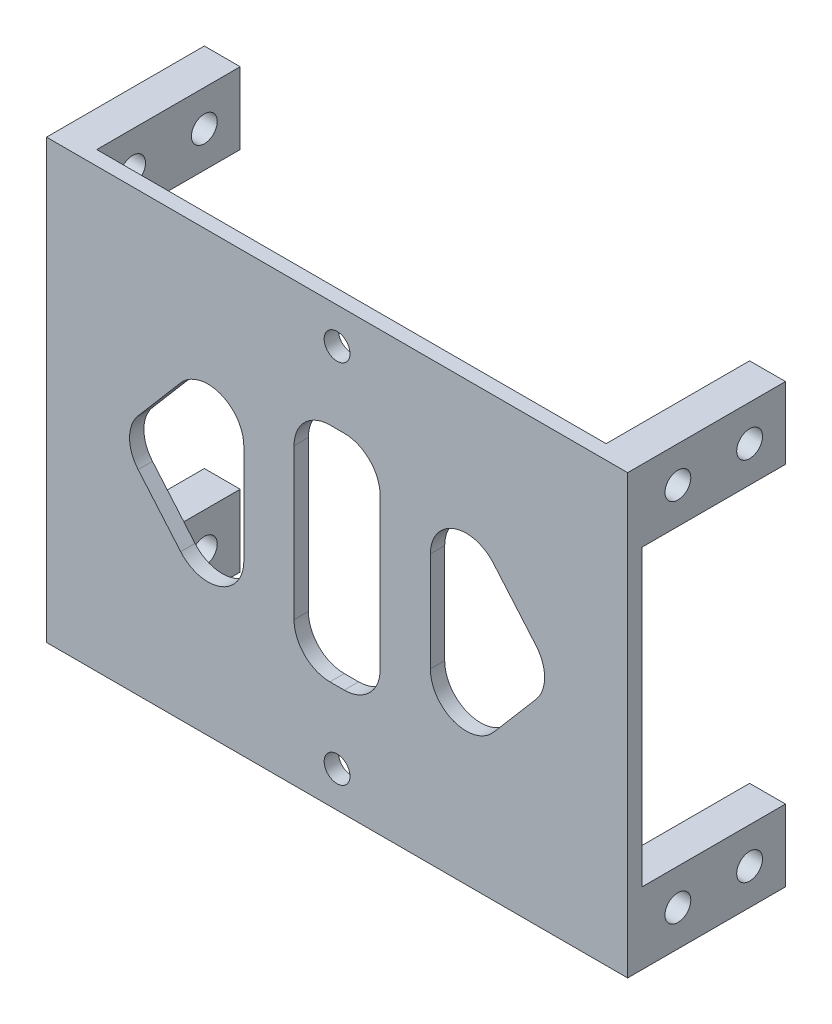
ISO-10303-21;
HEADER;
FILE_DESCRIPTION(('STEP AP214'),'2;1');
FILE_NAME('part.step','',(''),(''),'','','');
FILE_SCHEMA(('AUTOMOTIVE_DESIGN { 1 0 10303 214 1 1 1 1 }'));
ENDSEC;
DATA;
#1=APPLICATION_CONTEXT('core data for automotive mechanical design processes');
#2=APPLICATION_PROTOCOL_DEFINITION('international standard','automotive_design',2000,#1);
#3=PRODUCT_CONTEXT('',#1,'mechanical');
#4=PRODUCT('Part','Part','',(#3));
#5=PRODUCT_RELATED_PRODUCT_CATEGORY('part','',(#4));
#6=PRODUCT_DEFINITION_FORMATION('','',#4);
#7=PRODUCT_DEFINITION_CONTEXT('part definition',#1,'design');
#8=PRODUCT_DEFINITION('design','',#6,#7);
#9=PRODUCT_DEFINITION_SHAPE('','',#8);
#10=(LENGTH_UNIT() NAMED_UNIT(*) SI_UNIT(.MILLI.,.METRE.));
#11=(NAMED_UNIT(*) PLANE_ANGLE_UNIT() SI_UNIT($,.RADIAN.));
#12=(NAMED_UNIT(*) SI_UNIT($,.STERADIAN.) SOLID_ANGLE_UNIT());
#13=UNCERTAINTY_MEASURE_WITH_UNIT(LENGTH_MEASURE(1.E-05),#10,'distance_accuracy_value','');
#14=(GEOMETRIC_REPRESENTATION_CONTEXT(3) GLOBAL_UNCERTAINTY_ASSIGNED_CONTEXT((#13)) GLOBAL_UNIT_ASSIGNED_CONTEXT((#10,
#11,#12)) REPRESENTATION_CONTEXT('',''));
#15=CARTESIAN_POINT('',(0.,0.,0.));
#16=DIRECTION('',(0.,0.,1.));
#17=DIRECTION('',(1.,0.,0.));
#18=AXIS2_PLACEMENT_3D('',#15,#16,#17);
#19=CARTESIAN_POINT('',(0.,0.,0.));
#20=DIRECTION('',(0.,0.,-1.));
#21=DIRECTION('',(-1.,0.,0.));
#22=AXIS2_PLACEMENT_3D('',#19,#20,#21);
#23=PLANE('',#22);
#24=CARTESIAN_POINT('',(40.5,56.,0.));
#25=DIRECTION('',(0.,0.,1.));
#26=DIRECTION('',(1.,0.,0.));
#27=AXIS2_PLACEMENT_3D('',#24,#25,#26);
#28=CIRCLE('',#27,1.8);
#29=CARTESIAN_POINT('',(42.3,56.,0.));
#30=VERTEX_POINT('',#29);
#31=EDGE_CURVE('E498',#30,#30,#28,.T.);
#32=ORIENTED_EDGE('',*,*,#31,.T.);
#33=EDGE_LOOP('',(#32));
#34=FACE_BOUND('',#33,.T.);
#35=CARTESIAN_POINT('',(40.5,5.,0.));
#36=DIRECTION('',(0.,0.,1.));
#37=DIRECTION('',(1.,0.,0.));
#38=AXIS2_PLACEMENT_3D('',#35,#36,#37);
#39=CIRCLE('',#38,1.8);
#40=CARTESIAN_POINT('',(42.3,5.,0.));
#41=VERTEX_POINT('',#40);
#42=EDGE_CURVE('E483',#41,#41,#39,.T.);
#43=ORIENTED_EDGE('',*,*,#42,.T.);
#44=EDGE_LOOP('',(#43));
#45=FACE_BOUND('',#44,.T.);
#46=DIRECTION('',(0.,1.,0.));
#47=VECTOR('',#46,1.);
#48=CARTESIAN_POINT('',(27.5,51.,0.));
#49=LINE('',#48,#47);
#50=CARTESIAN_POINT('',(27.5,23.5581896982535,0.));
#51=VERTEX_POINT('',#50);
#52=CARTESIAN_POINT('',(27.5,37.4418103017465,0.));
#53=VERTEX_POINT('',#52);
#54=EDGE_CURVE('E487',#51,#53,#49,.T.);
#55=ORIENTED_EDGE('',*,*,#54,.T.);
#56=CARTESIAN_POINT('',(22.5,37.4418103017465,0.));
#57=DIRECTION('',(0.,0.,-1.));
#58=DIRECTION('',(-1.,0.,0.));
#59=AXIS2_PLACEMENT_3D('',#56,#57,#58);
#60=CIRCLE('',#59,5.);
#61=CARTESIAN_POINT('',(18.6971774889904,40.6881222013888,0.));
#62=VERTEX_POINT('',#61);
#63=EDGE_CURVE('E684',#53,#62,#60,.F.);
#64=ORIENTED_EDGE('',*,*,#63,.T.);
#65=DIRECTION('',(-0.649262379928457,-0.760564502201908,0.));
#66=VECTOR('',#65,1.);
#67=CARTESIAN_POINT('',(9.99999999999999,30.5,0.));
#68=LINE('',#67,#66);
#69=CARTESIAN_POINT('',(12.7712418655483,33.7463118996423,0.));
#70=VERTEX_POINT('',#69);
#71=EDGE_CURVE('E476',#62,#70,#68,.T.);
#72=ORIENTED_EDGE('',*,*,#71,.T.);
#73=CARTESIAN_POINT('',(16.5740643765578,30.5,0.));
#74=DIRECTION('',(0.,0.,-1.));
#75=DIRECTION('',(-1.,0.,0.));
#76=AXIS2_PLACEMENT_3D('',#73,#74,#75);
#77=CIRCLE('',#76,5.);
#78=CARTESIAN_POINT('',(12.7712418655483,27.2536881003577,0.));
#79=VERTEX_POINT('',#78);
#80=EDGE_CURVE('E52',#70,#79,#77,.F.);
#81=ORIENTED_EDGE('',*,*,#80,.T.);
#82=DIRECTION('',(0.649262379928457,-0.760564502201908,0.));
#83=VECTOR('',#82,1.);
#84=CARTESIAN_POINT('',(27.5,10.,0.));
#85=LINE('',#84,#83);
#86=CARTESIAN_POINT('',(18.6971774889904,20.3118777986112,0.));
#87=VERTEX_POINT('',#86);
#88=EDGE_CURVE('E460',#79,#87,#85,.T.);
#89=ORIENTED_EDGE('',*,*,#88,.T.);
#90=CARTESIAN_POINT('',(22.5,23.5581896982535,0.));
#91=DIRECTION('',(0.,0.,-1.));
#92=DIRECTION('',(-1.,0.,0.));
#93=AXIS2_PLACEMENT_3D('',#90,#91,#92);
#94=CIRCLE('',#93,5.);
#95=EDGE_CURVE('E648',#87,#51,#94,.F.);
#96=ORIENTED_EDGE('',*,*,#95,.T.);
#97=EDGE_LOOP('',(#55,#64,#72,#81,#89,#96));
#98=FACE_BOUND('',#97,.T.);
#99=DIRECTION('',(0.,-1.,0.));
#100=VECTOR('',#99,1.);
#101=CARTESIAN_POINT('',(53.5,51.,0.));
#102=LINE('',#101,#100);
#103=CARTESIAN_POINT('',(53.5,37.4418103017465,0.));
#104=VERTEX_POINT('',#103);
#105=CARTESIAN_POINT('',(53.5,23.5581896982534,0.));
#106=VERTEX_POINT('',#105);
#107=EDGE_CURVE('E464',#104,#106,#102,.T.);
#108=ORIENTED_EDGE('',*,*,#107,.T.);
#109=CARTESIAN_POINT('',(58.5,23.5581896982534,0.));
#110=DIRECTION('',(0.,0.,-1.));
#111=DIRECTION('',(-1.,0.,0.));
#112=AXIS2_PLACEMENT_3D('',#109,#110,#111);
#113=CIRCLE('',#112,5.);
#114=CARTESIAN_POINT('',(62.3028225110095,20.3118777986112,0.));
#115=VERTEX_POINT('',#114);
#116=EDGE_CURVE('E660',#106,#115,#113,.F.);
#117=ORIENTED_EDGE('',*,*,#116,.T.);
#118=DIRECTION('',(0.649262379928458,0.760564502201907,0.));
#119=VECTOR('',#118,1.);
#120=CARTESIAN_POINT('',(53.5,10.,0.));
#121=LINE('',#120,#119);
#122=CARTESIAN_POINT('',(68.2287581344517,27.2536881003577,0.));
#123=VERTEX_POINT('',#122);
#124=EDGE_CURVE('E452',#115,#123,#121,.T.);
#125=ORIENTED_EDGE('',*,*,#124,.T.);
#126=CARTESIAN_POINT('',(64.4259356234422,30.5,0.));
#127=DIRECTION('',(0.,0.,-1.));
#128=DIRECTION('',(-1.,0.,0.));
#129=AXIS2_PLACEMENT_3D('',#126,#127,#128);
#130=CIRCLE('',#129,5.);
#131=CARTESIAN_POINT('',(68.2287581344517,33.7463118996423,0.));
#132=VERTEX_POINT('',#131);
#133=EDGE_CURVE('E636',#123,#132,#130,.F.);
#134=ORIENTED_EDGE('',*,*,#133,.T.);
#135=DIRECTION('',(-0.649262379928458,0.760564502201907,0.));
#136=VECTOR('',#135,1.);
#137=CARTESIAN_POINT('',(71.,30.5,0.));
#138=LINE('',#137,#136);
#139=CARTESIAN_POINT('',(62.3028225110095,40.6881222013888,0.));
#140=VERTEX_POINT('',#139);
#141=EDGE_CURVE('E432',#132,#140,#138,.T.);
#142=ORIENTED_EDGE('',*,*,#141,.T.);
#143=CARTESIAN_POINT('',(58.5,37.4418103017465,0.));
#144=DIRECTION('',(0.,0.,-1.));
#145=DIRECTION('',(-1.,0.,0.));
#146=AXIS2_PLACEMENT_3D('',#143,#144,#145);
#147=CIRCLE('',#146,5.);
#148=EDGE_CURVE('E666',#140,#104,#147,.F.);
#149=ORIENTED_EDGE('',*,*,#148,.T.);
#150=EDGE_LOOP('',(#108,#117,#125,#134,#142,#149));
#151=FACE_BOUND('',#150,.T.);
#152=DIRECTION('',(0.,1.,0.));
#153=VECTOR('',#152,1.);
#154=CARTESIAN_POINT('',(46.5,46.,0.));
#155=LINE('',#154,#153);
#156=CARTESIAN_POINT('',(46.5,20.,0.));
#157=VERTEX_POINT('',#156);
#158=CARTESIAN_POINT('',(46.5,41.,0.));
#159=VERTEX_POINT('',#158);
#160=EDGE_CURVE('E440',#157,#159,#155,.T.);
#161=ORIENTED_EDGE('',*,*,#160,.T.);
#162=CARTESIAN_POINT('',(41.5,41.,0.));
#163=DIRECTION('',(0.,0.,-1.));
#164=DIRECTION('',(-1.,0.,0.));
#165=AXIS2_PLACEMENT_3D('',#162,#163,#164);
#166=CIRCLE('',#165,5.);
#167=CARTESIAN_POINT('',(41.5,46.,0.));
#168=VERTEX_POINT('',#167);
#169=EDGE_CURVE('E678',#159,#168,#166,.F.);
#170=ORIENTED_EDGE('',*,*,#169,.T.);
#171=DIRECTION('',(-1.,0.,0.));
#172=VECTOR('',#171,1.);
#173=CARTESIAN_POINT('',(34.5,46.,0.));
#174=LINE('',#173,#172);
#175=CARTESIAN_POINT('',(39.5,46.,0.));
#176=VERTEX_POINT('',#175);
#177=EDGE_CURVE('E420',#168,#176,#174,.T.);
#178=ORIENTED_EDGE('',*,*,#177,.T.);
#179=CARTESIAN_POINT('',(39.5,41.,0.));
#180=DIRECTION('',(0.,0.,-1.));
#181=DIRECTION('',(-1.,0.,0.));
#182=AXIS2_PLACEMENT_3D('',#179,#180,#181);
#183=CIRCLE('',#182,5.);
#184=CARTESIAN_POINT('',(34.5,41.,0.));
#185=VERTEX_POINT('',#184);
#186=EDGE_CURVE('E672',#176,#185,#183,.F.);
#187=ORIENTED_EDGE('',*,*,#186,.T.);
#188=DIRECTION('',(0.,-1.,0.));
#189=VECTOR('',#188,1.);
#190=CARTESIAN_POINT('',(34.5,15.,0.));
#191=LINE('',#190,#189);
#192=CARTESIAN_POINT('',(34.5,20.,0.));
#193=VERTEX_POINT('',#192);
#194=EDGE_CURVE('E414',#185,#193,#191,.T.);
#195=ORIENTED_EDGE('',*,*,#194,.T.);
#196=CARTESIAN_POINT('',(39.5,20.,0.));
#197=DIRECTION('',(0.,0.,-1.));
#198=DIRECTION('',(-1.,0.,0.));
#199=AXIS2_PLACEMENT_3D('',#196,#197,#198);
#200=CIRCLE('',#199,5.);
#201=CARTESIAN_POINT('',(39.5,15.,0.));
#202=VERTEX_POINT('',#201);
#203=EDGE_CURVE('E654',#193,#202,#200,.F.);
#204=ORIENTED_EDGE('',*,*,#203,.T.);
#205=DIRECTION('',(1.,0.,0.));
#206=VECTOR('',#205,1.);
#207=CARTESIAN_POINT('',(46.5,15.,0.));
#208=LINE('',#207,#206);
#209=CARTESIAN_POINT('',(41.5,15.,0.));
#210=VERTEX_POINT('',#209);
#211=EDGE_CURVE('E436',#202,#210,#208,.T.);
#212=ORIENTED_EDGE('',*,*,#211,.T.);
#213=CARTESIAN_POINT('',(41.5,20.,0.));
#214=DIRECTION('',(0.,0.,-1.));
#215=DIRECTION('',(-1.,0.,0.));
#216=AXIS2_PLACEMENT_3D('',#213,#214,#215);
#217=CIRCLE('',#216,5.);
#218=EDGE_CURVE('E642',#210,#157,#217,.F.);
#219=ORIENTED_EDGE('',*,*,#218,.T.);
#220=EDGE_LOOP('',(#161,#170,#178,#187,#195,#204,#212,#219));
#221=FACE_BOUND('',#220,.T.);
#222=DIRECTION('',(0.,-1.,0.));
#223=VECTOR('',#222,1.);
#224=CARTESIAN_POINT('',(4.99999999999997,0.,0.));
#225=LINE('',#224,#223);
#226=CARTESIAN_POINT('',(4.99999999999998,10.,0.));
#227=VERTEX_POINT('',#226);
#228=CARTESIAN_POINT('',(4.99999999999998,0.,0.));
#229=VERTEX_POINT('',#228);
#230=EDGE_CURVE('E290',#227,#229,#225,.T.);
#231=ORIENTED_EDGE('',*,*,#230,.F.);
#232=DIRECTION('',(1.,0.,0.));
#233=VECTOR('',#232,1.);
#234=CARTESIAN_POINT('',(0.,10.,0.));
#235=LINE('',#234,#233);
#236=CARTESIAN_POINT('',(0.,10.,0.));
#237=VERTEX_POINT('',#236);
#238=EDGE_CURVE('E277',#237,#227,#235,.T.);
#239=ORIENTED_EDGE('',*,*,#238,.F.);
#240=DIRECTION('',(0.,-1.,0.));
#241=VECTOR('',#240,1.);
#242=CARTESIAN_POINT('',(0.,0.,0.));
#243=LINE('',#242,#241);
#244=CARTESIAN_POINT('',(0.,51.,0.));
#245=VERTEX_POINT('',#244);
#246=EDGE_CURVE('E506',#245,#237,#243,.T.);
#247=ORIENTED_EDGE('',*,*,#246,.F.);
#248=DIRECTION('',(-1.,0.,0.));
#249=VECTOR('',#248,1.);
#250=CARTESIAN_POINT('',(0.,51.,0.));
#251=LINE('',#250,#249);
#252=CARTESIAN_POINT('',(4.99999999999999,51.,0.));
#253=VERTEX_POINT('',#252);
#254=EDGE_CURVE('E331',#253,#245,#251,.T.);
#255=ORIENTED_EDGE('',*,*,#254,.F.);
#256=DIRECTION('',(0.,-1.,0.));
#257=VECTOR('',#256,1.);
#258=CARTESIAN_POINT('',(5.,61.,0.));
#259=LINE('',#258,#257);
#260=CARTESIAN_POINT('',(5.,61.,0.));
#261=VERTEX_POINT('',#260);
#262=EDGE_CURVE('E334',#261,#253,#259,.T.);
#263=ORIENTED_EDGE('',*,*,#262,.F.);
#264=DIRECTION('',(-1.,0.,0.));
#265=VECTOR('',#264,1.);
#266=CARTESIAN_POINT('',(0.,61.,0.));
#267=LINE('',#266,#265);
#268=CARTESIAN_POINT('',(76.,61.,0.));
#269=VERTEX_POINT('',#268);
#270=EDGE_CURVE('E515',#269,#261,#267,.T.);
#271=ORIENTED_EDGE('',*,*,#270,.F.);
#272=DIRECTION('',(0.,1.,0.));
#273=VECTOR('',#272,1.);
#274=CARTESIAN_POINT('',(76.,61.,0.));
#275=LINE('',#274,#273);
#276=CARTESIAN_POINT('',(76.,51.,0.));
#277=VERTEX_POINT('',#276);
#278=EDGE_CURVE('E386',#277,#269,#275,.T.);
#279=ORIENTED_EDGE('',*,*,#278,.F.);
#280=DIRECTION('',(-1.,0.,0.));
#281=VECTOR('',#280,1.);
#282=CARTESIAN_POINT('',(81.,51.,0.));
#283=LINE('',#282,#281);
#284=CARTESIAN_POINT('',(81.,51.,0.));
#285=VERTEX_POINT('',#284);
#286=EDGE_CURVE('E369',#285,#277,#283,.T.);
#287=ORIENTED_EDGE('',*,*,#286,.F.);
#288=DIRECTION('',(0.,1.,0.));
#289=VECTOR('',#288,1.);
#290=CARTESIAN_POINT('',(81.,0.,0.));
#291=LINE('',#290,#289);
#292=CARTESIAN_POINT('',(81.,10.,0.));
#293=VERTEX_POINT('',#292);
#294=EDGE_CURVE('E529',#293,#285,#291,.T.);
#295=ORIENTED_EDGE('',*,*,#294,.F.);
#296=DIRECTION('',(1.,0.,0.));
#297=VECTOR('',#296,1.);
#298=CARTESIAN_POINT('',(81.,10.,0.));
#299=LINE('',#298,#297);
#300=CARTESIAN_POINT('',(76.,10.,0.));
#301=VERTEX_POINT('',#300);
#302=EDGE_CURVE('E361',#301,#293,#299,.T.);
#303=ORIENTED_EDGE('',*,*,#302,.F.);
#304=DIRECTION('',(0.,1.,0.));
#305=VECTOR('',#304,1.);
#306=CARTESIAN_POINT('',(76.,0.,0.));
#307=LINE('',#306,#305);
#308=CARTESIAN_POINT('',(76.,0.,0.));
#309=VERTEX_POINT('',#308);
#310=EDGE_CURVE('E365',#309,#301,#307,.T.);
#311=ORIENTED_EDGE('',*,*,#310,.F.);
#312=DIRECTION('',(1.,0.,0.));
#313=VECTOR('',#312,1.);
#314=CARTESIAN_POINT('',(0.,0.,0.));
#315=LINE('',#314,#313);
#316=EDGE_CURVE('E302',#229,#309,#315,.T.);
#317=ORIENTED_EDGE('',*,*,#316,.F.);
#318=EDGE_LOOP('',(#231,#239,#247,#255,#263,#271,#279,#287,#295,#303,#311,#317));
#319=FACE_BOUND('',#318,.T.);
#320=ADVANCED_FACE('F43',(#34,#45,#98,#151,#221,#319),#23,.T.);
#321=CARTESIAN_POINT('',(0.,0.,2.));
#322=DIRECTION('',(0.,0.,-1.));
#323=DIRECTION('',(-1.,0.,0.));
#324=AXIS2_PLACEMENT_3D('',#321,#322,#323);
#325=PLANE('',#324);
#326=DIRECTION('',(-0.649262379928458,0.760564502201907,0.));
#327=VECTOR('',#326,1.);
#328=CARTESIAN_POINT('',(71.,30.5,2.));
#329=LINE('',#328,#327);
#330=CARTESIAN_POINT('',(68.2287581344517,33.7463118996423,2.));
#331=VERTEX_POINT('',#330);
#332=CARTESIAN_POINT('',(62.3028225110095,40.6881222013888,2.));
#333=VERTEX_POINT('',#332);
#334=EDGE_CURVE('E447',#331,#333,#329,.T.);
#335=ORIENTED_EDGE('',*,*,#334,.F.);
#336=CARTESIAN_POINT('',(64.4259356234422,30.5,2.));
#337=DIRECTION('',(0.,0.,-1.));
#338=DIRECTION('',(-1.,0.,0.));
#339=AXIS2_PLACEMENT_3D('',#336,#337,#338);
#340=CIRCLE('',#339,5.);
#341=CARTESIAN_POINT('',(68.2287581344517,27.2536881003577,2.));
#342=VERTEX_POINT('',#341);
#343=EDGE_CURVE('E639',#331,#342,#340,.T.);
#344=ORIENTED_EDGE('',*,*,#343,.T.);
#345=DIRECTION('',(0.649262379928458,0.760564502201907,0.));
#346=VECTOR('',#345,1.);
#347=CARTESIAN_POINT('',(53.5,10.,2.));
#348=LINE('',#347,#346);
#349=CARTESIAN_POINT('',(62.3028225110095,20.3118777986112,2.));
#350=VERTEX_POINT('',#349);
#351=EDGE_CURVE('E456',#350,#342,#348,.T.);
#352=ORIENTED_EDGE('',*,*,#351,.F.);
#353=CARTESIAN_POINT('',(58.5,23.5581896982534,2.));
#354=DIRECTION('',(0.,0.,-1.));
#355=DIRECTION('',(-1.,0.,0.));
#356=AXIS2_PLACEMENT_3D('',#353,#354,#355);
#357=CIRCLE('',#356,5.);
#358=CARTESIAN_POINT('',(53.5,23.5581896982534,2.));
#359=VERTEX_POINT('',#358);
#360=EDGE_CURVE('E663',#350,#359,#357,.T.);
#361=ORIENTED_EDGE('',*,*,#360,.T.);
#362=DIRECTION('',(0.,-1.,0.));
#363=VECTOR('',#362,1.);
#364=CARTESIAN_POINT('',(53.5,51.,2.));
#365=LINE('',#364,#363);
#366=CARTESIAN_POINT('',(53.5,37.4418103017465,2.));
#367=VERTEX_POINT('',#366);
#368=EDGE_CURVE('E451',#367,#359,#365,.T.);
#369=ORIENTED_EDGE('',*,*,#368,.F.);
#370=CARTESIAN_POINT('',(58.5,37.4418103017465,2.));
#371=DIRECTION('',(0.,0.,-1.));
#372=DIRECTION('',(-1.,0.,0.));
#373=AXIS2_PLACEMENT_3D('',#370,#371,#372);
#374=CIRCLE('',#373,5.);
#375=EDGE_CURVE('E669',#367,#333,#374,.T.);
#376=ORIENTED_EDGE('',*,*,#375,.T.);
#377=EDGE_LOOP('',(#335,#344,#352,#361,#369,#376));
#378=FACE_BOUND('',#377,.T.);
#379=CARTESIAN_POINT('',(40.5,5.,2.));
#380=DIRECTION('',(0.,0.,1.));
#381=DIRECTION('',(1.,0.,0.));
#382=AXIS2_PLACEMENT_3D('',#379,#380,#381);
#383=CIRCLE('',#382,1.8);
#384=CARTESIAN_POINT('',(42.3,5.,2.));
#385=VERTEX_POINT('',#384);
#386=EDGE_CURVE('E494',#385,#385,#383,.T.);
#387=ORIENTED_EDGE('',*,*,#386,.F.);
#388=EDGE_LOOP('',(#387));
#389=FACE_BOUND('',#388,.T.);
#390=CARTESIAN_POINT('',(40.5,56.,2.));
#391=DIRECTION('',(0.,0.,1.));
#392=DIRECTION('',(1.,0.,0.));
#393=AXIS2_PLACEMENT_3D('',#390,#391,#392);
#394=CIRCLE('',#393,1.8);
#395=CARTESIAN_POINT('',(42.3,56.,2.));
#396=VERTEX_POINT('',#395);
#397=EDGE_CURVE('E502',#396,#396,#394,.T.);
#398=ORIENTED_EDGE('',*,*,#397,.F.);
#399=EDGE_LOOP('',(#398));
#400=FACE_BOUND('',#399,.T.);
#401=DIRECTION('',(0.,-1.,0.));
#402=VECTOR('',#401,1.);
#403=CARTESIAN_POINT('',(0.,0.,2.));
#404=LINE('',#403,#402);
#405=CARTESIAN_POINT('',(0.,61.,2.));
#406=VERTEX_POINT('',#405);
#407=CARTESIAN_POINT('',(0.,0.,2.));
#408=VERTEX_POINT('',#407);
#409=EDGE_CURVE('E510',#406,#408,#404,.T.);
#410=ORIENTED_EDGE('',*,*,#409,.T.);
#411=DIRECTION('',(1.,0.,0.));
#412=VECTOR('',#411,1.);
#413=CARTESIAN_POINT('',(0.,0.,2.));
#414=LINE('',#413,#412);
#415=CARTESIAN_POINT('',(81.,0.,2.));
#416=VERTEX_POINT('',#415);
#417=EDGE_CURVE('E514',#408,#416,#414,.T.);
#418=ORIENTED_EDGE('',*,*,#417,.T.);
#419=DIRECTION('',(0.,1.,0.));
#420=VECTOR('',#419,1.);
#421=CARTESIAN_POINT('',(81.,0.,2.));
#422=LINE('',#421,#420);
#423=CARTESIAN_POINT('',(81.,61.,2.));
#424=VERTEX_POINT('',#423);
#425=EDGE_CURVE('E518',#416,#424,#422,.T.);
#426=ORIENTED_EDGE('',*,*,#425,.T.);
#427=DIRECTION('',(-1.,0.,0.));
#428=VECTOR('',#427,1.);
#429=CARTESIAN_POINT('',(0.,61.,2.));
#430=LINE('',#429,#428);
#431=EDGE_CURVE('E521',#424,#406,#430,.T.);
#432=ORIENTED_EDGE('',*,*,#431,.T.);
#433=EDGE_LOOP('',(#410,#418,#426,#432));
#434=FACE_BOUND('',#433,.T.);
#435=DIRECTION('',(0.649262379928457,-0.760564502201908,0.));
#436=VECTOR('',#435,1.);
#437=CARTESIAN_POINT('',(27.5,10.,2.));
#438=LINE('',#437,#436);
#439=CARTESIAN_POINT('',(12.7712418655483,27.2536881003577,2.));
#440=VERTEX_POINT('',#439);
#441=CARTESIAN_POINT('',(18.6971774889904,20.3118777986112,2.));
#442=VERTEX_POINT('',#441);
#443=EDGE_CURVE('E471',#440,#442,#438,.T.);
#444=ORIENTED_EDGE('',*,*,#443,.F.);
#445=CARTESIAN_POINT('',(16.5740643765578,30.5,2.));
#446=DIRECTION('',(0.,0.,-1.));
#447=DIRECTION('',(-1.,0.,0.));
#448=AXIS2_PLACEMENT_3D('',#445,#446,#447);
#449=CIRCLE('',#448,5.);
#450=CARTESIAN_POINT('',(12.7712418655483,33.7463118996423,2.));
#451=VERTEX_POINT('',#450);
#452=EDGE_CURVE('E11',#440,#451,#449,.T.);
#453=ORIENTED_EDGE('',*,*,#452,.T.);
#454=DIRECTION('',(-0.649262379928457,-0.760564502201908,0.));
#455=VECTOR('',#454,1.);
#456=CARTESIAN_POINT('',(9.99999999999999,30.5,2.));
#457=LINE('',#456,#455);
#458=CARTESIAN_POINT('',(18.6971774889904,40.6881222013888,2.));
#459=VERTEX_POINT('',#458);
#460=EDGE_CURVE('E480',#459,#451,#457,.T.);
#461=ORIENTED_EDGE('',*,*,#460,.F.);
#462=CARTESIAN_POINT('',(22.5,37.4418103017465,2.));
#463=DIRECTION('',(0.,0.,-1.));
#464=DIRECTION('',(-1.,0.,0.));
#465=AXIS2_PLACEMENT_3D('',#462,#463,#464);
#466=CIRCLE('',#465,5.);
#467=CARTESIAN_POINT('',(27.5,37.4418103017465,2.));
#468=VERTEX_POINT('',#467);
#469=EDGE_CURVE('E687',#459,#468,#466,.T.);
#470=ORIENTED_EDGE('',*,*,#469,.T.);
#471=DIRECTION('',(0.,1.,0.));
#472=VECTOR('',#471,1.);
#473=CARTESIAN_POINT('',(27.5,51.,2.));
#474=LINE('',#473,#472);
#475=CARTESIAN_POINT('',(27.5,23.5581896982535,2.));
#476=VERTEX_POINT('',#475);
#477=EDGE_CURVE('E475',#476,#468,#474,.T.);
#478=ORIENTED_EDGE('',*,*,#477,.F.);
#479=CARTESIAN_POINT('',(22.5,23.5581896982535,2.));
#480=DIRECTION('',(0.,0.,-1.));
#481=DIRECTION('',(-1.,0.,0.));
#482=AXIS2_PLACEMENT_3D('',#479,#480,#481);
#483=CIRCLE('',#482,5.);
#484=EDGE_CURVE('E651',#476,#442,#483,.T.);
#485=ORIENTED_EDGE('',*,*,#484,.T.);
#486=EDGE_LOOP('',(#444,#453,#461,#470,#478,#485));
#487=FACE_BOUND('',#486,.T.);
#488=DIRECTION('',(0.,-1.,0.));
#489=VECTOR('',#488,1.);
#490=CARTESIAN_POINT('',(34.5,15.,2.));
#491=LINE('',#490,#489);
#492=CARTESIAN_POINT('',(34.5,41.,2.));
#493=VERTEX_POINT('',#492);
#494=CARTESIAN_POINT('',(34.5,20.,2.));
#495=VERTEX_POINT('',#494);
#496=EDGE_CURVE('E415',#493,#495,#491,.T.);
#497=ORIENTED_EDGE('',*,*,#496,.F.);
#498=CARTESIAN_POINT('',(39.5,41.,2.));
#499=DIRECTION('',(0.,0.,-1.));
#500=DIRECTION('',(-1.,0.,0.));
#501=AXIS2_PLACEMENT_3D('',#498,#499,#500);
#502=CIRCLE('',#501,5.);
#503=CARTESIAN_POINT('',(39.5,46.,2.));
#504=VERTEX_POINT('',#503);
#505=EDGE_CURVE('E675',#493,#504,#502,.T.);
#506=ORIENTED_EDGE('',*,*,#505,.T.);
#507=DIRECTION('',(-1.,0.,0.));
#508=VECTOR('',#507,1.);
#509=CARTESIAN_POINT('',(34.5,46.,2.));
#510=LINE('',#509,#508);
#511=CARTESIAN_POINT('',(41.5,46.,2.));
#512=VERTEX_POINT('',#511);
#513=EDGE_CURVE('E428',#512,#504,#510,.T.);
#514=ORIENTED_EDGE('',*,*,#513,.F.);
#515=CARTESIAN_POINT('',(41.5,41.,2.));
#516=DIRECTION('',(0.,0.,-1.));
#517=DIRECTION('',(-1.,0.,0.));
#518=AXIS2_PLACEMENT_3D('',#515,#516,#517);
#519=CIRCLE('',#518,5.);
#520=CARTESIAN_POINT('',(46.5,41.,2.));
#521=VERTEX_POINT('',#520);
#522=EDGE_CURVE('E681',#512,#521,#519,.T.);
#523=ORIENTED_EDGE('',*,*,#522,.T.);
#524=DIRECTION('',(0.,1.,0.));
#525=VECTOR('',#524,1.);
#526=CARTESIAN_POINT('',(46.5,46.,2.));
#527=LINE('',#526,#525);
#528=CARTESIAN_POINT('',(46.5,20.,2.));
#529=VERTEX_POINT('',#528);
#530=EDGE_CURVE('E424',#529,#521,#527,.T.);
#531=ORIENTED_EDGE('',*,*,#530,.F.);
#532=CARTESIAN_POINT('',(41.5,20.,2.));
#533=DIRECTION('',(0.,0.,-1.));
#534=DIRECTION('',(-1.,0.,0.));
#535=AXIS2_PLACEMENT_3D('',#532,#533,#534);
#536=CIRCLE('',#535,5.);
#537=CARTESIAN_POINT('',(41.5,15.,2.));
#538=VERTEX_POINT('',#537);
#539=EDGE_CURVE('E645',#529,#538,#536,.T.);
#540=ORIENTED_EDGE('',*,*,#539,.T.);
#541=DIRECTION('',(1.,0.,0.));
#542=VECTOR('',#541,1.);
#543=CARTESIAN_POINT('',(46.5,15.,2.));
#544=LINE('',#543,#542);
#545=CARTESIAN_POINT('',(39.5,15.,2.));
#546=VERTEX_POINT('',#545);
#547=EDGE_CURVE('E419',#546,#538,#544,.T.);
#548=ORIENTED_EDGE('',*,*,#547,.F.);
#549=CARTESIAN_POINT('',(39.5,20.,2.));
#550=DIRECTION('',(0.,0.,-1.));
#551=DIRECTION('',(-1.,0.,0.));
#552=AXIS2_PLACEMENT_3D('',#549,#550,#551);
#553=CIRCLE('',#552,5.);
#554=EDGE_CURVE('E657',#546,#495,#553,.T.);
#555=ORIENTED_EDGE('',*,*,#554,.T.);
#556=EDGE_LOOP('',(#497,#506,#514,#523,#531,#540,#548,#555));
#557=FACE_BOUND('',#556,.T.);
#558=ADVANCED_FACE('F701',(#378,#389,#400,#434,#487,#557),#325,.F.);
#559=CARTESIAN_POINT('',(0.,0.,2.));
#560=DIRECTION('',(1.,0.,0.));
#561=DIRECTION('',(0.,1.,0.));
#562=AXIS2_PLACEMENT_3D('',#559,#560,#561);
#563=PLANE('',#562);
#564=CARTESIAN_POINT('',(0.,56.,-5.));
#565=DIRECTION('',(-1.,0.,0.));
#566=DIRECTION('',(0.,-1.,0.));
#567=AXIS2_PLACEMENT_3D('',#564,#565,#566);
#568=CIRCLE('',#567,1.8);
#569=CARTESIAN_POINT('',(0.,54.2,-5.));
#570=VERTEX_POINT('',#569);
#571=EDGE_CURVE('E1364',#570,#570,#568,.T.);
#572=ORIENTED_EDGE('',*,*,#571,.F.);
#573=EDGE_LOOP('',(#572));
#574=FACE_BOUND('',#573,.T.);
#575=CARTESIAN_POINT('',(0.,5.00000000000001,-15.));
#576=DIRECTION('',(-1.,0.,0.));
#577=DIRECTION('',(0.,-1.,0.));
#578=AXIS2_PLACEMENT_3D('',#575,#576,#577);
#579=CIRCLE('',#578,1.8);
#580=CARTESIAN_POINT('',(0.,3.20000000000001,-15.));
#581=VERTEX_POINT('',#580);
#582=EDGE_CURVE('E1372',#581,#581,#579,.T.);
#583=ORIENTED_EDGE('',*,*,#582,.F.);
#584=EDGE_LOOP('',(#583));
#585=FACE_BOUND('',#584,.T.);
#586=CARTESIAN_POINT('',(0.,5.00000000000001,-5.));
#587=DIRECTION('',(-1.,0.,0.));
#588=DIRECTION('',(0.,-1.,0.));
#589=AXIS2_PLACEMENT_3D('',#586,#587,#588);
#590=CIRCLE('',#589,1.8);
#591=CARTESIAN_POINT('',(0.,3.20000000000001,-5.));
#592=VERTEX_POINT('',#591);
#593=EDGE_CURVE('E1380',#592,#592,#590,.T.);
#594=ORIENTED_EDGE('',*,*,#593,.F.);
#595=EDGE_LOOP('',(#594));
#596=FACE_BOUND('',#595,.T.);
#597=CARTESIAN_POINT('',(0.,56.,-15.));
#598=DIRECTION('',(-1.,0.,0.));
#599=DIRECTION('',(0.,-1.,0.));
#600=AXIS2_PLACEMENT_3D('',#597,#598,#599);
#601=CIRCLE('',#600,1.8);
#602=CARTESIAN_POINT('',(0.,54.2,-15.));
#603=VERTEX_POINT('',#602);
#604=EDGE_CURVE('E1360',#603,#603,#601,.T.);
#605=ORIENTED_EDGE('',*,*,#604,.F.);
#606=EDGE_LOOP('',(#605));
#607=FACE_BOUND('',#606,.T.);
#608=DIRECTION('',(0.,0.,-1.));
#609=VECTOR('',#608,1.);
#610=CARTESIAN_POINT('',(0.,61.,2.));
#611=LINE('',#610,#609);
#612=CARTESIAN_POINT('',(0.,61.,-20.));
#613=VERTEX_POINT('',#612);
#614=EDGE_CURVE('E524',#406,#613,#611,.T.);
#615=ORIENTED_EDGE('',*,*,#614,.T.);
#616=DIRECTION('',(0.,1.,0.));
#617=VECTOR('',#616,1.);
#618=CARTESIAN_POINT('',(0.,61.,-20.));
#619=LINE('',#618,#617);
#620=CARTESIAN_POINT('',(0.,51.,-20.));
#621=VERTEX_POINT('',#620);
#622=EDGE_CURVE('E335',#621,#613,#619,.T.);
#623=ORIENTED_EDGE('',*,*,#622,.F.);
#624=DIRECTION('',(0.,0.,1.));
#625=VECTOR('',#624,1.);
#626=CARTESIAN_POINT('',(0.,51.,-20.));
#627=LINE('',#626,#625);
#628=EDGE_CURVE('E326',#621,#245,#627,.T.);
#629=ORIENTED_EDGE('',*,*,#628,.T.);
#630=ORIENTED_EDGE('',*,*,#246,.T.);
#631=DIRECTION('',(0.,0.,1.));
#632=VECTOR('',#631,1.);
#633=CARTESIAN_POINT('',(0.,10.,-20.));
#634=LINE('',#633,#632);
#635=CARTESIAN_POINT('',(0.,10.,-20.));
#636=VERTEX_POINT('',#635);
#637=EDGE_CURVE('E283',#636,#237,#634,.T.);
#638=ORIENTED_EDGE('',*,*,#637,.F.);
#639=DIRECTION('',(0.,1.,0.));
#640=VECTOR('',#639,1.);
#641=CARTESIAN_POINT('',(0.,0.,-20.));
#642=LINE('',#641,#640);
#643=CARTESIAN_POINT('',(0.,0.,-20.));
#644=VERTEX_POINT('',#643);
#645=EDGE_CURVE('E304',#644,#636,#642,.T.);
#646=ORIENTED_EDGE('',*,*,#645,.F.);
#647=DIRECTION('',(0.,0.,-1.));
#648=VECTOR('',#647,1.);
#649=CARTESIAN_POINT('',(0.,0.,2.));
#650=LINE('',#649,#648);
#651=EDGE_CURVE('E543',#408,#644,#650,.T.);
#652=ORIENTED_EDGE('',*,*,#651,.F.);
#653=ORIENTED_EDGE('',*,*,#409,.F.);
#654=EDGE_LOOP('',(#615,#623,#629,#630,#638,#646,#652,#653));
#655=FACE_BOUND('',#654,.T.);
#656=ADVANCED_FACE('F734',(#574,#585,#596,#607,#655),#563,.F.);
#657=CARTESIAN_POINT('',(0.,0.,2.));
#658=DIRECTION('',(0.,1.,0.));
#659=DIRECTION('',(0.,0.,1.));
#660=AXIS2_PLACEMENT_3D('',#657,#658,#659);
#661=PLANE('',#660);
#662=ORIENTED_EDGE('',*,*,#651,.T.);
#663=DIRECTION('',(-1.,0.,0.));
#664=VECTOR('',#663,1.);
#665=CARTESIAN_POINT('',(0.,0.,-20.));
#666=LINE('',#665,#664);
#667=CARTESIAN_POINT('',(4.99999999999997,0.,-20.));
#668=VERTEX_POINT('',#667);
#669=EDGE_CURVE('E312',#668,#644,#666,.T.);
#670=ORIENTED_EDGE('',*,*,#669,.F.);
#671=DIRECTION('',(0.,0.,1.));
#672=VECTOR('',#671,1.);
#673=CARTESIAN_POINT('',(4.99999999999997,0.,-20.));
#674=LINE('',#673,#672);
#675=EDGE_CURVE('E299',#668,#229,#674,.T.);
#676=ORIENTED_EDGE('',*,*,#675,.T.);
#677=ORIENTED_EDGE('',*,*,#316,.T.);
#678=DIRECTION('',(0.,0.,1.));
#679=VECTOR('',#678,1.);
#680=CARTESIAN_POINT('',(76.,0.,-20.));
#681=LINE('',#680,#679);
#682=CARTESIAN_POINT('',(76.,0.,-20.));
#683=VERTEX_POINT('',#682);
#684=EDGE_CURVE('E338',#683,#309,#681,.T.);
#685=ORIENTED_EDGE('',*,*,#684,.F.);
#686=DIRECTION('',(-1.,0.,0.));
#687=VECTOR('',#686,1.);
#688=CARTESIAN_POINT('',(81.,0.,-20.));
#689=LINE('',#688,#687);
#690=CARTESIAN_POINT('',(81.,0.,-20.));
#691=VERTEX_POINT('',#690);
#692=EDGE_CURVE('E375',#691,#683,#689,.T.);
#693=ORIENTED_EDGE('',*,*,#692,.F.);
#694=DIRECTION('',(0.,0.,-1.));
#695=VECTOR('',#694,1.);
#696=CARTESIAN_POINT('',(81.,0.,2.));
#697=LINE('',#696,#695);
#698=EDGE_CURVE('E540',#416,#691,#697,.T.);
#699=ORIENTED_EDGE('',*,*,#698,.F.);
#700=ORIENTED_EDGE('',*,*,#417,.F.);
#701=EDGE_LOOP('',(#662,#670,#676,#677,#685,#693,#699,#700));
#702=FACE_BOUND('',#701,.T.);
#703=ADVANCED_FACE('F748',(#702),#661,.F.);
#704=CARTESIAN_POINT('',(81.,0.,2.));
#705=DIRECTION('',(-1.,0.,0.));
#706=DIRECTION('',(0.,-1.,0.));
#707=AXIS2_PLACEMENT_3D('',#704,#705,#706);
#708=PLANE('',#707);
#709=CARTESIAN_POINT('',(81.,56.,-5.));
#710=DIRECTION('',(-1.,0.,0.));
#711=DIRECTION('',(0.,-1.,0.));
#712=AXIS2_PLACEMENT_3D('',#709,#710,#711);
#713=CIRCLE('',#712,1.8);
#714=CARTESIAN_POINT('',(81.,54.2,-5.));
#715=VERTEX_POINT('',#714);
#716=EDGE_CURVE('E1368',#715,#715,#713,.T.);
#717=ORIENTED_EDGE('',*,*,#716,.T.);
#718=EDGE_LOOP('',(#717));
#719=FACE_BOUND('',#718,.T.);
#720=CARTESIAN_POINT('',(81.,5.00000000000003,-15.));
#721=DIRECTION('',(-1.,0.,0.));
#722=DIRECTION('',(0.,-1.,0.));
#723=AXIS2_PLACEMENT_3D('',#720,#721,#722);
#724=CIRCLE('',#723,1.8);
#725=CARTESIAN_POINT('',(81.,3.20000000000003,-15.));
#726=VERTEX_POINT('',#725);
#727=EDGE_CURVE('E1376',#726,#726,#724,.T.);
#728=ORIENTED_EDGE('',*,*,#727,.T.);
#729=EDGE_LOOP('',(#728));
#730=FACE_BOUND('',#729,.T.);
#731=CARTESIAN_POINT('',(81.,5.00000000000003,-5.));
#732=DIRECTION('',(-1.,0.,0.));
#733=DIRECTION('',(0.,-1.,0.));
#734=AXIS2_PLACEMENT_3D('',#731,#732,#733);
#735=CIRCLE('',#734,1.8);
#736=CARTESIAN_POINT('',(81.,3.20000000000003,-5.));
#737=VERTEX_POINT('',#736);
#738=EDGE_CURVE('E1384',#737,#737,#735,.T.);
#739=ORIENTED_EDGE('',*,*,#738,.T.);
#740=EDGE_LOOP('',(#739));
#741=FACE_BOUND('',#740,.T.);
#742=CARTESIAN_POINT('',(81.,56.,-15.));
#743=DIRECTION('',(-1.,0.,0.));
#744=DIRECTION('',(0.,-1.,0.));
#745=AXIS2_PLACEMENT_3D('',#742,#743,#744);
#746=CIRCLE('',#745,1.8);
#747=CARTESIAN_POINT('',(81.,54.2,-15.));
#748=VERTEX_POINT('',#747);
#749=EDGE_CURVE('E552',#748,#748,#746,.T.);
#750=ORIENTED_EDGE('',*,*,#749,.T.);
#751=EDGE_LOOP('',(#750));
#752=FACE_BOUND('',#751,.T.);
#753=ORIENTED_EDGE('',*,*,#698,.T.);
#754=DIRECTION('',(0.,-1.,0.));
#755=VECTOR('',#754,1.);
#756=CARTESIAN_POINT('',(81.,0.,-20.));
#757=LINE('',#756,#755);
#758=CARTESIAN_POINT('',(81.,10.,-20.));
#759=VERTEX_POINT('',#758);
#760=EDGE_CURVE('E366',#759,#691,#757,.T.);
#761=ORIENTED_EDGE('',*,*,#760,.F.);
#762=DIRECTION('',(0.,0.,1.));
#763=VECTOR('',#762,1.);
#764=CARTESIAN_POINT('',(81.,10.,-20.));
#765=LINE('',#764,#763);
#766=EDGE_CURVE('E357',#759,#293,#765,.T.);
#767=ORIENTED_EDGE('',*,*,#766,.T.);
#768=ORIENTED_EDGE('',*,*,#294,.T.);
#769=DIRECTION('',(0.,0.,1.));
#770=VECTOR('',#769,1.);
#771=CARTESIAN_POINT('',(81.,51.,-20.));
#772=LINE('',#771,#770);
#773=CARTESIAN_POINT('',(81.,51.,-20.));
#774=VERTEX_POINT('',#773);
#775=EDGE_CURVE('E410',#774,#285,#772,.T.);
#776=ORIENTED_EDGE('',*,*,#775,.F.);
#777=DIRECTION('',(0.,-1.,0.));
#778=VECTOR('',#777,1.);
#779=CARTESIAN_POINT('',(81.,61.,-20.));
#780=LINE('',#779,#778);
#781=CARTESIAN_POINT('',(81.,61.,-20.));
#782=VERTEX_POINT('',#781);
#783=EDGE_CURVE('E381',#782,#774,#780,.T.);
#784=ORIENTED_EDGE('',*,*,#783,.F.);
#785=DIRECTION('',(0.,0.,-1.));
#786=VECTOR('',#785,1.);
#787=CARTESIAN_POINT('',(81.,61.,2.));
#788=LINE('',#787,#786);
#789=EDGE_CURVE('E537',#424,#782,#788,.T.);
#790=ORIENTED_EDGE('',*,*,#789,.F.);
#791=ORIENTED_EDGE('',*,*,#425,.F.);
#792=EDGE_LOOP('',(#753,#761,#767,#768,#776,#784,#790,#791));
#793=FACE_BOUND('',#792,.T.);
#794=ADVANCED_FACE('F744',(#719,#730,#741,#752,#793),#708,.F.);
#795=CARTESIAN_POINT('',(0.,61.,2.));
#796=DIRECTION('',(0.,-1.,0.));
#797=DIRECTION('',(0.,0.,-1.));
#798=AXIS2_PLACEMENT_3D('',#795,#796,#797);
#799=PLANE('',#798);
#800=ORIENTED_EDGE('',*,*,#789,.T.);
#801=DIRECTION('',(1.,0.,0.));
#802=VECTOR('',#801,1.);
#803=CARTESIAN_POINT('',(81.,61.,-20.));
#804=LINE('',#803,#802);
#805=CARTESIAN_POINT('',(76.,61.,-20.));
#806=VERTEX_POINT('',#805);
#807=EDGE_CURVE('E392',#806,#782,#804,.T.);
#808=ORIENTED_EDGE('',*,*,#807,.F.);
#809=DIRECTION('',(0.,0.,1.));
#810=VECTOR('',#809,1.);
#811=CARTESIAN_POINT('',(76.,61.,-20.));
#812=LINE('',#811,#810);
#813=EDGE_CURVE('E396',#806,#269,#812,.T.);
#814=ORIENTED_EDGE('',*,*,#813,.T.);
#815=ORIENTED_EDGE('',*,*,#270,.T.);
#816=DIRECTION('',(0.,0.,1.));
#817=VECTOR('',#816,1.);
#818=CARTESIAN_POINT('',(5.,61.,-20.));
#819=LINE('',#818,#817);
#820=CARTESIAN_POINT('',(5.,61.,-20.));
#821=VERTEX_POINT('',#820);
#822=EDGE_CURVE('E289',#821,#261,#819,.T.);
#823=ORIENTED_EDGE('',*,*,#822,.F.);
#824=DIRECTION('',(1.,0.,0.));
#825=VECTOR('',#824,1.);
#826=CARTESIAN_POINT('',(0.,61.,-20.));
#827=LINE('',#826,#825);
#828=EDGE_CURVE('E344',#613,#821,#827,.T.);
#829=ORIENTED_EDGE('',*,*,#828,.F.);
#830=ORIENTED_EDGE('',*,*,#614,.F.);
#831=ORIENTED_EDGE('',*,*,#431,.F.);
#832=EDGE_LOOP('',(#800,#808,#814,#815,#823,#829,#830,#831));
#833=FACE_BOUND('',#832,.T.);
#834=ADVANCED_FACE('F740',(#833),#799,.F.);
#835=CARTESIAN_POINT('',(40.5,56.,2.));
#836=DIRECTION('',(0.,0.,-1.));
#837=DIRECTION('',(-1.,0.,0.));
#838=AXIS2_PLACEMENT_3D('',#835,#836,#837);
#839=CYLINDRICAL_SURFACE('',#838,1.8);
#840=ORIENTED_EDGE('',*,*,#397,.T.);
#841=EDGE_LOOP('',(#840));
#842=FACE_BOUND('',#841,.T.);
#843=ORIENTED_EDGE('',*,*,#31,.F.);
#844=EDGE_LOOP('',(#843));
#845=FACE_BOUND('',#844,.T.);
#846=ADVANCED_FACE('F743',(#842,#845),#839,.F.);
#847=CARTESIAN_POINT('',(40.5,5.,2.));
#848=DIRECTION('',(0.,0.,-1.));
#849=DIRECTION('',(-1.,0.,0.));
#850=AXIS2_PLACEMENT_3D('',#847,#848,#849);
#851=CYLINDRICAL_SURFACE('',#850,1.8);
#852=ORIENTED_EDGE('',*,*,#386,.T.);
#853=EDGE_LOOP('',(#852));
#854=FACE_BOUND('',#853,.T.);
#855=ORIENTED_EDGE('',*,*,#42,.F.);
#856=EDGE_LOOP('',(#855));
#857=FACE_BOUND('',#856,.T.);
#858=ADVANCED_FACE('F1178',(#854,#857),#851,.F.);
#859=CARTESIAN_POINT('',(27.5,10.,2.));
#860=DIRECTION('',(0.760564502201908,0.649262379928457,0.));
#861=DIRECTION('',(-0.649262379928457,0.760564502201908,0.));
#862=AXIS2_PLACEMENT_3D('',#859,#860,#861);
#863=PLANE('',#862);
#864=ORIENTED_EDGE('',*,*,#443,.T.);
#865=DIRECTION('',(0.,0.,-1.));
#866=VECTOR('',#865,1.);
#867=CARTESIAN_POINT('',(18.6971774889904,20.3118777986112,0.));
#868=LINE('',#867,#866);
#869=EDGE_CURVE('E598',#442,#87,#868,.T.);
#870=ORIENTED_EDGE('',*,*,#869,.T.);
#871=ORIENTED_EDGE('',*,*,#88,.F.);
#872=DIRECTION('',(0.,0.,-1.));
#873=VECTOR('',#872,1.);
#874=CARTESIAN_POINT('',(12.7712418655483,27.2536881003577,2.));
#875=LINE('',#874,#873);
#876=EDGE_CURVE('E595',#79,#440,#875,.F.);
#877=ORIENTED_EDGE('',*,*,#876,.T.);
#878=EDGE_LOOP('',(#864,#870,#871,#877));
#879=FACE_BOUND('',#878,.T.);
#880=ADVANCED_FACE('F697',(#879),#863,.T.);
#881=CARTESIAN_POINT('',(27.5,51.,2.));
#882=DIRECTION('',(-1.,0.,0.));
#883=DIRECTION('',(0.,-1.,0.));
#884=AXIS2_PLACEMENT_3D('',#881,#882,#883);
#885=PLANE('',#884);
#886=ORIENTED_EDGE('',*,*,#54,.F.);
#887=DIRECTION('',(0.,0.,-1.));
#888=VECTOR('',#887,1.);
#889=CARTESIAN_POINT('',(27.5,23.5581896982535,2.));
#890=LINE('',#889,#888);
#891=EDGE_CURVE('E606',#51,#476,#890,.F.);
#892=ORIENTED_EDGE('',*,*,#891,.T.);
#893=ORIENTED_EDGE('',*,*,#477,.T.);
#894=DIRECTION('',(0.,0.,-1.));
#895=VECTOR('',#894,1.);
#896=CARTESIAN_POINT('',(27.5,37.4418103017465,0.));
#897=LINE('',#896,#895);
#898=EDGE_CURVE('E602',#468,#53,#897,.T.);
#899=ORIENTED_EDGE('',*,*,#898,.T.);
#900=EDGE_LOOP('',(#886,#892,#893,#899));
#901=FACE_BOUND('',#900,.T.);
#902=ADVANCED_FACE('F709',(#901),#885,.T.);
#903=CARTESIAN_POINT('',(9.99999999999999,30.5,2.));
#904=DIRECTION('',(0.760564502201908,-0.649262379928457,0.));
#905=DIRECTION('',(0.649262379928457,0.760564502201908,0.));
#906=AXIS2_PLACEMENT_3D('',#903,#904,#905);
#907=PLANE('',#906);
#908=ORIENTED_EDGE('',*,*,#71,.F.);
#909=DIRECTION('',(0.,0.,-1.));
#910=VECTOR('',#909,1.);
#911=CARTESIAN_POINT('',(18.6971774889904,40.6881222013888,2.));
#912=LINE('',#911,#910);
#913=EDGE_CURVE('E64',#62,#459,#912,.F.);
#914=ORIENTED_EDGE('',*,*,#913,.T.);
#915=ORIENTED_EDGE('',*,*,#460,.T.);
#916=DIRECTION('',(0.,0.,-1.));
#917=VECTOR('',#916,1.);
#918=CARTESIAN_POINT('',(12.7712418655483,33.7463118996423,0.));
#919=LINE('',#918,#917);
#920=EDGE_CURVE('E630',#451,#70,#919,.T.);
#921=ORIENTED_EDGE('',*,*,#920,.T.);
#922=EDGE_LOOP('',(#908,#914,#915,#921));
#923=FACE_BOUND('',#922,.T.);
#924=ADVANCED_FACE('F699',(#923),#907,.T.);
#925=CARTESIAN_POINT('',(71.,30.5,2.));
#926=DIRECTION('',(-0.760564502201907,-0.649262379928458,0.));
#927=DIRECTION('',(0.649262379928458,-0.760564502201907,0.));
#928=AXIS2_PLACEMENT_3D('',#925,#926,#927);
#929=PLANE('',#928);
#930=ORIENTED_EDGE('',*,*,#141,.F.);
#931=DIRECTION('',(0.,0.,-1.));
#932=VECTOR('',#931,1.);
#933=CARTESIAN_POINT('',(68.2287581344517,33.7463118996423,2.));
#934=LINE('',#933,#932);
#935=EDGE_CURVE('E578',#132,#331,#934,.F.);
#936=ORIENTED_EDGE('',*,*,#935,.T.);
#937=ORIENTED_EDGE('',*,*,#334,.T.);
#938=DIRECTION('',(0.,0.,-1.));
#939=VECTOR('',#938,1.);
#940=CARTESIAN_POINT('',(62.3028225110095,40.6881222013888,0.));
#941=LINE('',#940,#939);
#942=EDGE_CURVE('E574',#333,#140,#941,.T.);
#943=ORIENTED_EDGE('',*,*,#942,.T.);
#944=EDGE_LOOP('',(#930,#936,#937,#943));
#945=FACE_BOUND('',#944,.T.);
#946=ADVANCED_FACE('F790',(#945),#929,.T.);
#947=CARTESIAN_POINT('',(53.5,51.,2.));
#948=DIRECTION('',(1.,0.,0.));
#949=DIRECTION('',(0.,1.,0.));
#950=AXIS2_PLACEMENT_3D('',#947,#948,#949);
#951=PLANE('',#950);
#952=ORIENTED_EDGE('',*,*,#368,.T.);
#953=DIRECTION('',(0.,0.,-1.));
#954=VECTOR('',#953,1.);
#955=CARTESIAN_POINT('',(53.5,23.5581896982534,0.));
#956=LINE('',#955,#954);
#957=EDGE_CURVE('E619',#359,#106,#956,.T.);
#958=ORIENTED_EDGE('',*,*,#957,.T.);
#959=ORIENTED_EDGE('',*,*,#107,.F.);
#960=DIRECTION('',(0.,0.,-1.));
#961=VECTOR('',#960,1.);
#962=CARTESIAN_POINT('',(53.5,37.4418103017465,2.));
#963=LINE('',#962,#961);
#964=EDGE_CURVE('E616',#104,#367,#963,.F.);
#965=ORIENTED_EDGE('',*,*,#964,.T.);
#966=EDGE_LOOP('',(#952,#958,#959,#965));
#967=FACE_BOUND('',#966,.T.);
#968=ADVANCED_FACE('F782',(#967),#951,.T.);
#969=CARTESIAN_POINT('',(53.5,10.,2.));
#970=DIRECTION('',(-0.760564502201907,0.649262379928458,0.));
#971=DIRECTION('',(-0.649262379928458,-0.760564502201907,0.));
#972=AXIS2_PLACEMENT_3D('',#969,#970,#971);
#973=PLANE('',#972);
#974=ORIENTED_EDGE('',*,*,#351,.T.);
#975=DIRECTION('',(0.,0.,-1.));
#976=VECTOR('',#975,1.);
#977=CARTESIAN_POINT('',(68.2287581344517,27.2536881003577,0.));
#978=LINE('',#977,#976);
#979=EDGE_CURVE('E570',#342,#123,#978,.T.);
#980=ORIENTED_EDGE('',*,*,#979,.T.);
#981=ORIENTED_EDGE('',*,*,#124,.F.);
#982=DIRECTION('',(0.,0.,-1.));
#983=VECTOR('',#982,1.);
#984=CARTESIAN_POINT('',(62.3028225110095,20.3118777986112,2.));
#985=LINE('',#984,#983);
#986=EDGE_CURVE('E546',#115,#350,#985,.F.);
#987=ORIENTED_EDGE('',*,*,#986,.T.);
#988=EDGE_LOOP('',(#974,#980,#981,#987));
#989=FACE_BOUND('',#988,.T.);
#990=ADVANCED_FACE('F774',(#989),#973,.T.);
#991=CARTESIAN_POINT('',(34.5,15.,2.));
#992=DIRECTION('',(1.,0.,0.));
#993=DIRECTION('',(0.,0.,-1.));
#994=AXIS2_PLACEMENT_3D('',#991,#992,#993);
#995=PLANE('',#994);
#996=ORIENTED_EDGE('',*,*,#496,.T.);
#997=DIRECTION('',(0.,0.,-1.));
#998=VECTOR('',#997,1.);
#999=CARTESIAN_POINT('',(34.5,20.,0.));
#1000=LINE('',#999,#998);
#1001=EDGE_CURVE('E612',#495,#193,#1000,.T.);
#1002=ORIENTED_EDGE('',*,*,#1001,.T.);
#1003=ORIENTED_EDGE('',*,*,#194,.F.);
#1004=DIRECTION('',(0.,0.,-1.));
#1005=VECTOR('',#1004,1.);
#1006=CARTESIAN_POINT('',(34.5,41.,2.));
#1007=LINE('',#1006,#1005);
#1008=EDGE_CURVE('E609',#185,#493,#1007,.F.);
#1009=ORIENTED_EDGE('',*,*,#1008,.T.);
#1010=EDGE_LOOP('',(#996,#1002,#1003,#1009));
#1011=FACE_BOUND('',#1010,.T.);
#1012=ADVANCED_FACE('F811',(#1011),#995,.T.);
#1013=CARTESIAN_POINT('',(46.5,15.,2.));
#1014=DIRECTION('',(0.,1.,0.));
#1015=DIRECTION('',(0.,0.,1.));
#1016=AXIS2_PLACEMENT_3D('',#1013,#1014,#1015);
#1017=PLANE('',#1016);
#1018=ORIENTED_EDGE('',*,*,#547,.T.);
#1019=DIRECTION('',(0.,0.,-1.));
#1020=VECTOR('',#1019,1.);
#1021=CARTESIAN_POINT('',(41.5,15.,0.));
#1022=LINE('',#1021,#1020);
#1023=EDGE_CURVE('E584',#538,#210,#1022,.T.);
#1024=ORIENTED_EDGE('',*,*,#1023,.T.);
#1025=ORIENTED_EDGE('',*,*,#211,.F.);
#1026=DIRECTION('',(0.,0.,-1.));
#1027=VECTOR('',#1026,1.);
#1028=CARTESIAN_POINT('',(39.5,15.,2.));
#1029=LINE('',#1028,#1027);
#1030=EDGE_CURVE('E581',#202,#546,#1029,.F.);
#1031=ORIENTED_EDGE('',*,*,#1030,.T.);
#1032=EDGE_LOOP('',(#1018,#1024,#1025,#1031));
#1033=FACE_BOUND('',#1032,.T.);
#1034=ADVANCED_FACE('F805',(#1033),#1017,.T.);
#1035=CARTESIAN_POINT('',(46.5,46.,2.));
#1036=DIRECTION('',(-1.,0.,0.));
#1037=DIRECTION('',(0.,0.,1.));
#1038=AXIS2_PLACEMENT_3D('',#1035,#1036,#1037);
#1039=PLANE('',#1038);
#1040=ORIENTED_EDGE('',*,*,#160,.F.);
#1041=DIRECTION('',(0.,0.,-1.));
#1042=VECTOR('',#1041,1.);
#1043=CARTESIAN_POINT('',(46.5,20.,2.));
#1044=LINE('',#1043,#1042);
#1045=EDGE_CURVE('E592',#157,#529,#1044,.F.);
#1046=ORIENTED_EDGE('',*,*,#1045,.T.);
#1047=ORIENTED_EDGE('',*,*,#530,.T.);
#1048=DIRECTION('',(0.,0.,-1.));
#1049=VECTOR('',#1048,1.);
#1050=CARTESIAN_POINT('',(46.5,41.,0.));
#1051=LINE('',#1050,#1049);
#1052=EDGE_CURVE('E588',#521,#159,#1051,.T.);
#1053=ORIENTED_EDGE('',*,*,#1052,.T.);
#1054=EDGE_LOOP('',(#1040,#1046,#1047,#1053));
#1055=FACE_BOUND('',#1054,.T.);
#1056=ADVANCED_FACE('F796',(#1055),#1039,.T.);
#1057=CARTESIAN_POINT('',(34.5,46.,2.));
#1058=DIRECTION('',(0.,-1.,0.));
#1059=DIRECTION('',(0.,0.,-1.));
#1060=AXIS2_PLACEMENT_3D('',#1057,#1058,#1059);
#1061=PLANE('',#1060);
#1062=ORIENTED_EDGE('',*,*,#513,.T.);
#1063=DIRECTION('',(0.,0.,-1.));
#1064=VECTOR('',#1063,1.);
#1065=CARTESIAN_POINT('',(39.5,46.,0.));
#1066=LINE('',#1065,#1064);
#1067=EDGE_CURVE('E626',#504,#176,#1066,.T.);
#1068=ORIENTED_EDGE('',*,*,#1067,.T.);
#1069=ORIENTED_EDGE('',*,*,#177,.F.);
#1070=DIRECTION('',(0.,0.,-1.));
#1071=VECTOR('',#1070,1.);
#1072=CARTESIAN_POINT('',(41.5,46.,2.));
#1073=LINE('',#1072,#1071);
#1074=EDGE_CURVE('E623',#168,#512,#1073,.F.);
#1075=ORIENTED_EDGE('',*,*,#1074,.T.);
#1076=EDGE_LOOP('',(#1062,#1068,#1069,#1075));
#1077=FACE_BOUND('',#1076,.T.);
#1078=ADVANCED_FACE('F820',(#1077),#1061,.T.);
#1079=CARTESIAN_POINT('',(81.,51.,-20.));
#1080=DIRECTION('',(0.,1.,0.));
#1081=DIRECTION('',(0.,0.,1.));
#1082=AXIS2_PLACEMENT_3D('',#1079,#1080,#1081);
#1083=PLANE('',#1082);
#1084=ORIENTED_EDGE('',*,*,#286,.T.);
#1085=DIRECTION('',(0.,0.,1.));
#1086=VECTOR('',#1085,1.);
#1087=CARTESIAN_POINT('',(76.,51.,-20.));
#1088=LINE('',#1087,#1086);
#1089=CARTESIAN_POINT('',(76.,51.,-20.));
#1090=VERTEX_POINT('',#1089);
#1091=EDGE_CURVE('E406',#1090,#277,#1088,.T.);
#1092=ORIENTED_EDGE('',*,*,#1091,.F.);
#1093=DIRECTION('',(-1.,0.,0.));
#1094=VECTOR('',#1093,1.);
#1095=CARTESIAN_POINT('',(81.,51.,-20.));
#1096=LINE('',#1095,#1094);
#1097=EDGE_CURVE('E385',#774,#1090,#1096,.T.);
#1098=ORIENTED_EDGE('',*,*,#1097,.F.);
#1099=ORIENTED_EDGE('',*,*,#775,.T.);
#1100=EDGE_LOOP('',(#1084,#1092,#1098,#1099));
#1101=FACE_BOUND('',#1100,.T.);
#1102=ADVANCED_FACE('F1078',(#1101),#1083,.F.);
#1103=CARTESIAN_POINT('',(76.,61.,-20.));
#1104=DIRECTION('',(1.,0.,0.));
#1105=DIRECTION('',(0.,0.,-1.));
#1106=AXIS2_PLACEMENT_3D('',#1103,#1104,#1105);
#1107=PLANE('',#1106);
#1108=CARTESIAN_POINT('',(76.,56.,-5.));
#1109=DIRECTION('',(1.,0.,0.));
#1110=DIRECTION('',(0.,0.,-1.));
#1111=AXIS2_PLACEMENT_3D('',#1108,#1109,#1110);
#1112=CIRCLE('',#1111,1.8);
#1113=CARTESIAN_POINT('',(76.,56.,-6.8));
#1114=VERTEX_POINT('',#1113);
#1115=EDGE_CURVE('E567',#1114,#1114,#1112,.T.);
#1116=ORIENTED_EDGE('',*,*,#1115,.T.);
#1117=EDGE_LOOP('',(#1116));
#1118=FACE_BOUND('',#1117,.T.);
#1119=CARTESIAN_POINT('',(76.,56.,-15.));
#1120=DIRECTION('',(1.,0.,0.));
#1121=DIRECTION('',(0.,0.,-1.));
#1122=AXIS2_PLACEMENT_3D('',#1119,#1120,#1121);
#1123=CIRCLE('',#1122,1.8);
#1124=CARTESIAN_POINT('',(76.,56.,-16.8));
#1125=VERTEX_POINT('',#1124);
#1126=EDGE_CURVE('E562',#1125,#1125,#1123,.T.);
#1127=ORIENTED_EDGE('',*,*,#1126,.T.);
#1128=EDGE_LOOP('',(#1127));
#1129=FACE_BOUND('',#1128,.T.);
#1130=ORIENTED_EDGE('',*,*,#278,.T.);
#1131=ORIENTED_EDGE('',*,*,#813,.F.);
#1132=DIRECTION('',(0.,1.,0.));
#1133=VECTOR('',#1132,1.);
#1134=CARTESIAN_POINT('',(76.,61.,-20.));
#1135=LINE('',#1134,#1133);
#1136=EDGE_CURVE('E389',#1090,#806,#1135,.T.);
#1137=ORIENTED_EDGE('',*,*,#1136,.F.);
#1138=ORIENTED_EDGE('',*,*,#1091,.T.);
#1139=EDGE_LOOP('',(#1130,#1131,#1137,#1138));
#1140=FACE_BOUND('',#1139,.T.);
#1141=ADVANCED_FACE('F1068',(#1118,#1129,#1140),#1107,.F.);
#1142=CARTESIAN_POINT('',(0.,0.,-20.));
#1143=DIRECTION('',(0.,0.,-1.));
#1144=DIRECTION('',(-1.,0.,0.));
#1145=AXIS2_PLACEMENT_3D('',#1142,#1143,#1144);
#1146=PLANE('',#1145);
#1147=ORIENTED_EDGE('',*,*,#783,.T.);
#1148=ORIENTED_EDGE('',*,*,#1097,.T.);
#1149=ORIENTED_EDGE('',*,*,#1136,.T.);
#1150=ORIENTED_EDGE('',*,*,#807,.T.);
#1151=EDGE_LOOP('',(#1147,#1148,#1149,#1150));
#1152=FACE_BOUND('',#1151,.T.);
#1153=ADVANCED_FACE('F1058',(#1152),#1146,.T.);
#1154=CARTESIAN_POINT('',(76.,0.,-20.));
#1155=DIRECTION('',(1.,0.,0.));
#1156=DIRECTION('',(0.,0.,-1.));
#1157=AXIS2_PLACEMENT_3D('',#1154,#1155,#1156);
#1158=PLANE('',#1157);
#1159=CARTESIAN_POINT('',(76.,5.00000000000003,-15.));
#1160=DIRECTION('',(1.,0.,0.));
#1161=DIRECTION('',(0.,0.,-1.));
#1162=AXIS2_PLACEMENT_3D('',#1159,#1160,#1161);
#1163=CIRCLE('',#1162,1.8);
#1164=CARTESIAN_POINT('',(76.,5.00000000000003,-16.8));
#1165=VERTEX_POINT('',#1164);
#1166=EDGE_CURVE('E557',#1165,#1165,#1163,.T.);
#1167=ORIENTED_EDGE('',*,*,#1166,.T.);
#1168=EDGE_LOOP('',(#1167));
#1169=FACE_BOUND('',#1168,.T.);
#1170=CARTESIAN_POINT('',(76.,5.00000000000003,-5.));
#1171=DIRECTION('',(1.,0.,0.));
#1172=DIRECTION('',(0.,0.,-1.));
#1173=AXIS2_PLACEMENT_3D('',#1170,#1171,#1172);
#1174=CIRCLE('',#1173,1.8);
#1175=CARTESIAN_POINT('',(76.,5.00000000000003,-6.8));
#1176=VERTEX_POINT('',#1175);
#1177=EDGE_CURVE('E551',#1176,#1176,#1174,.T.);
#1178=ORIENTED_EDGE('',*,*,#1177,.T.);
#1179=EDGE_LOOP('',(#1178));
#1180=FACE_BOUND('',#1179,.T.);
#1181=ORIENTED_EDGE('',*,*,#310,.T.);
#1182=DIRECTION('',(0.,0.,1.));
#1183=VECTOR('',#1182,1.);
#1184=CARTESIAN_POINT('',(76.,10.,-20.));
#1185=LINE('',#1184,#1183);
#1186=CARTESIAN_POINT('',(76.,10.,-20.));
#1187=VERTEX_POINT('',#1186);
#1188=EDGE_CURVE('E353',#1187,#301,#1185,.T.);
#1189=ORIENTED_EDGE('',*,*,#1188,.F.);
#1190=DIRECTION('',(0.,1.,0.));
#1191=VECTOR('',#1190,1.);
#1192=CARTESIAN_POINT('',(76.,0.,-20.));
#1193=LINE('',#1192,#1191);
#1194=EDGE_CURVE('E372',#683,#1187,#1193,.T.);
#1195=ORIENTED_EDGE('',*,*,#1194,.F.);
#1196=ORIENTED_EDGE('',*,*,#684,.T.);
#1197=EDGE_LOOP('',(#1181,#1189,#1195,#1196));
#1198=FACE_BOUND('',#1197,.T.);
#1199=ADVANCED_FACE('F1048',(#1169,#1180,#1198),#1158,.F.);
#1200=CARTESIAN_POINT('',(81.,10.,-20.));
#1201=DIRECTION('',(0.,-1.,0.));
#1202=DIRECTION('',(1.,0.,0.));
#1203=AXIS2_PLACEMENT_3D('',#1200,#1201,#1202);
#1204=PLANE('',#1203);
#1205=ORIENTED_EDGE('',*,*,#302,.T.);
#1206=ORIENTED_EDGE('',*,*,#766,.F.);
#1207=DIRECTION('',(1.,0.,0.));
#1208=VECTOR('',#1207,1.);
#1209=CARTESIAN_POINT('',(81.,10.,-20.));
#1210=LINE('',#1209,#1208);
#1211=EDGE_CURVE('E360',#1187,#759,#1210,.T.);
#1212=ORIENTED_EDGE('',*,*,#1211,.F.);
#1213=ORIENTED_EDGE('',*,*,#1188,.T.);
#1214=EDGE_LOOP('',(#1205,#1206,#1212,#1213));
#1215=FACE_BOUND('',#1214,.T.);
#1216=ADVANCED_FACE('F1038',(#1215),#1204,.F.);
#1217=CARTESIAN_POINT('',(0.,0.,-20.));
#1218=DIRECTION('',(0.,0.,1.));
#1219=DIRECTION('',(1.,0.,0.));
#1220=AXIS2_PLACEMENT_3D('',#1217,#1218,#1219);
#1221=PLANE('',#1220);
#1222=ORIENTED_EDGE('',*,*,#760,.T.);
#1223=ORIENTED_EDGE('',*,*,#692,.T.);
#1224=ORIENTED_EDGE('',*,*,#1194,.T.);
#1225=ORIENTED_EDGE('',*,*,#1211,.T.);
#1226=EDGE_LOOP('',(#1222,#1223,#1224,#1225));
#1227=FACE_BOUND('',#1226,.T.);
#1228=ADVANCED_FACE('F1028',(#1227),#1221,.F.);
#1229=CARTESIAN_POINT('',(5.,61.,-20.));
#1230=DIRECTION('',(-1.,0.,0.));
#1231=DIRECTION('',(0.,-1.,0.));
#1232=AXIS2_PLACEMENT_3D('',#1229,#1230,#1231);
#1233=PLANE('',#1232);
#1234=CARTESIAN_POINT('',(5.,56.,-5.));
#1235=DIRECTION('',(-1.,0.,0.));
#1236=DIRECTION('',(0.,-1.,0.));
#1237=AXIS2_PLACEMENT_3D('',#1234,#1235,#1236);
#1238=CIRCLE('',#1237,1.8);
#1239=CARTESIAN_POINT('',(5.,54.2,-5.));
#1240=VERTEX_POINT('',#1239);
#1241=EDGE_CURVE('E563',#1240,#1240,#1238,.T.);
#1242=ORIENTED_EDGE('',*,*,#1241,.T.);
#1243=EDGE_LOOP('',(#1242));
#1244=FACE_BOUND('',#1243,.T.);
#1245=CARTESIAN_POINT('',(5.,56.,-15.));
#1246=DIRECTION('',(-1.,0.,0.));
#1247=DIRECTION('',(0.,-1.,0.));
#1248=AXIS2_PLACEMENT_3D('',#1245,#1246,#1247);
#1249=CIRCLE('',#1248,1.8);
#1250=CARTESIAN_POINT('',(5.,54.2,-15.));
#1251=VERTEX_POINT('',#1250);
#1252=EDGE_CURVE('E558',#1251,#1251,#1249,.T.);
#1253=ORIENTED_EDGE('',*,*,#1252,.T.);
#1254=EDGE_LOOP('',(#1253));
#1255=FACE_BOUND('',#1254,.T.);
#1256=ORIENTED_EDGE('',*,*,#262,.T.);
#1257=DIRECTION('',(0.,0.,1.));
#1258=VECTOR('',#1257,1.);
#1259=CARTESIAN_POINT('',(4.99999999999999,51.,-20.));
#1260=LINE('',#1259,#1258);
#1261=CARTESIAN_POINT('',(4.99999999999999,51.,-20.));
#1262=VERTEX_POINT('',#1261);
#1263=EDGE_CURVE('E322',#1262,#253,#1260,.T.);
#1264=ORIENTED_EDGE('',*,*,#1263,.F.);
#1265=DIRECTION('',(0.,-1.,0.));
#1266=VECTOR('',#1265,1.);
#1267=CARTESIAN_POINT('',(5.,61.,-20.));
#1268=LINE('',#1267,#1266);
#1269=EDGE_CURVE('E341',#821,#1262,#1268,.T.);
#1270=ORIENTED_EDGE('',*,*,#1269,.F.);
#1271=ORIENTED_EDGE('',*,*,#822,.T.);
#1272=EDGE_LOOP('',(#1256,#1264,#1270,#1271));
#1273=FACE_BOUND('',#1272,.T.);
#1274=ADVANCED_FACE('F1018',(#1244,#1255,#1273),#1233,.F.);
#1275=CARTESIAN_POINT('',(0.,51.,-20.));
#1276=DIRECTION('',(0.,1.,0.));
#1277=DIRECTION('',(0.,0.,1.));
#1278=AXIS2_PLACEMENT_3D('',#1275,#1276,#1277);
#1279=PLANE('',#1278);
#1280=ORIENTED_EDGE('',*,*,#254,.T.);
#1281=ORIENTED_EDGE('',*,*,#628,.F.);
#1282=DIRECTION('',(-1.,0.,0.));
#1283=VECTOR('',#1282,1.);
#1284=CARTESIAN_POINT('',(0.,51.,-20.));
#1285=LINE('',#1284,#1283);
#1286=EDGE_CURVE('E330',#1262,#621,#1285,.T.);
#1287=ORIENTED_EDGE('',*,*,#1286,.F.);
#1288=ORIENTED_EDGE('',*,*,#1263,.T.);
#1289=EDGE_LOOP('',(#1280,#1281,#1287,#1288));
#1290=FACE_BOUND('',#1289,.T.);
#1291=ADVANCED_FACE('F1008',(#1290),#1279,.F.);
#1292=CARTESIAN_POINT('',(0.,0.,-20.));
#1293=DIRECTION('',(0.,0.,1.));
#1294=DIRECTION('',(1.,0.,0.));
#1295=AXIS2_PLACEMENT_3D('',#1292,#1293,#1294);
#1296=PLANE('',#1295);
#1297=ORIENTED_EDGE('',*,*,#622,.T.);
#1298=ORIENTED_EDGE('',*,*,#828,.T.);
#1299=ORIENTED_EDGE('',*,*,#1269,.T.);
#1300=ORIENTED_EDGE('',*,*,#1286,.T.);
#1301=EDGE_LOOP('',(#1297,#1298,#1299,#1300));
#1302=FACE_BOUND('',#1301,.T.);
#1303=ADVANCED_FACE('F999',(#1302),#1296,.F.);
#1304=CARTESIAN_POINT('',(0.,10.,-20.));
#1305=DIRECTION('',(0.,-1.,0.));
#1306=DIRECTION('',(1.,0.,0.));
#1307=AXIS2_PLACEMENT_3D('',#1304,#1305,#1306);
#1308=PLANE('',#1307);
#1309=ORIENTED_EDGE('',*,*,#238,.T.);
#1310=DIRECTION('',(0.,0.,1.));
#1311=VECTOR('',#1310,1.);
#1312=CARTESIAN_POINT('',(4.99999999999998,10.,-20.));
#1313=LINE('',#1312,#1311);
#1314=CARTESIAN_POINT('',(4.99999999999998,10.,-20.));
#1315=VERTEX_POINT('',#1314);
#1316=EDGE_CURVE('E280',#1315,#227,#1313,.T.);
#1317=ORIENTED_EDGE('',*,*,#1316,.F.);
#1318=DIRECTION('',(1.,0.,0.));
#1319=VECTOR('',#1318,1.);
#1320=CARTESIAN_POINT('',(0.,10.,-20.));
#1321=LINE('',#1320,#1319);
#1322=EDGE_CURVE('E308',#636,#1315,#1321,.T.);
#1323=ORIENTED_EDGE('',*,*,#1322,.F.);
#1324=ORIENTED_EDGE('',*,*,#637,.T.);
#1325=EDGE_LOOP('',(#1309,#1317,#1323,#1324));
#1326=FACE_BOUND('',#1325,.T.);
#1327=ADVANCED_FACE('F279',(#1326),#1308,.F.);
#1328=CARTESIAN_POINT('',(4.99999999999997,0.,-20.));
#1329=DIRECTION('',(-1.,0.,0.));
#1330=DIRECTION('',(0.,-1.,0.));
#1331=AXIS2_PLACEMENT_3D('',#1328,#1329,#1330);
#1332=PLANE('',#1331);
#1333=CARTESIAN_POINT('',(4.99999999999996,5.00000000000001,-15.));
#1334=DIRECTION('',(-1.,0.,0.));
#1335=DIRECTION('',(0.,-1.,0.));
#1336=AXIS2_PLACEMENT_3D('',#1333,#1334,#1335);
#1337=CIRCLE('',#1336,1.8);
#1338=CARTESIAN_POINT('',(4.99999999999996,3.20000000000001,-15.));
#1339=VERTEX_POINT('',#1338);
#1340=EDGE_CURVE('E553',#1339,#1339,#1337,.T.);
#1341=ORIENTED_EDGE('',*,*,#1340,.T.);
#1342=EDGE_LOOP('',(#1341));
#1343=FACE_BOUND('',#1342,.T.);
#1344=CARTESIAN_POINT('',(4.99999999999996,5.00000000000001,-5.));
#1345=DIRECTION('',(-1.,0.,0.));
#1346=DIRECTION('',(0.,-1.,0.));
#1347=AXIS2_PLACEMENT_3D('',#1344,#1345,#1346);
#1348=CIRCLE('',#1347,1.8);
#1349=CARTESIAN_POINT('',(4.99999999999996,3.20000000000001,-5.));
#1350=VERTEX_POINT('',#1349);
#1351=EDGE_CURVE('E547',#1350,#1350,#1348,.T.);
#1352=ORIENTED_EDGE('',*,*,#1351,.T.);
#1353=EDGE_LOOP('',(#1352));
#1354=FACE_BOUND('',#1353,.T.);
#1355=ORIENTED_EDGE('',*,*,#230,.T.);
#1356=ORIENTED_EDGE('',*,*,#675,.F.);
#1357=DIRECTION('',(0.,-1.,0.));
#1358=VECTOR('',#1357,1.);
#1359=CARTESIAN_POINT('',(4.99999999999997,0.,-20.));
#1360=LINE('',#1359,#1358);
#1361=EDGE_CURVE('E297',#1315,#668,#1360,.T.);
#1362=ORIENTED_EDGE('',*,*,#1361,.F.);
#1363=ORIENTED_EDGE('',*,*,#1316,.T.);
#1364=EDGE_LOOP('',(#1355,#1356,#1362,#1363));
#1365=FACE_BOUND('',#1364,.T.);
#1366=ADVANCED_FACE('F294',(#1343,#1354,#1365),#1332,.F.);
#1367=CARTESIAN_POINT('',(0.,0.,-20.));
#1368=DIRECTION('',(0.,0.,-1.));
#1369=DIRECTION('',(-1.,0.,0.));
#1370=AXIS2_PLACEMENT_3D('',#1367,#1368,#1369);
#1371=PLANE('',#1370);
#1372=ORIENTED_EDGE('',*,*,#645,.T.);
#1373=ORIENTED_EDGE('',*,*,#1322,.T.);
#1374=ORIENTED_EDGE('',*,*,#1361,.T.);
#1375=ORIENTED_EDGE('',*,*,#669,.T.);
#1376=EDGE_LOOP('',(#1372,#1373,#1374,#1375));
#1377=FACE_BOUND('',#1376,.T.);
#1378=ADVANCED_FACE('F972',(#1377),#1371,.T.);
#1379=CARTESIAN_POINT('',(81.,5.00000000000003,-5.));
#1380=DIRECTION('',(-1.,0.,0.));
#1381=DIRECTION('',(0.,-1.,0.));
#1382=AXIS2_PLACEMENT_3D('',#1379,#1380,#1381);
#1383=CYLINDRICAL_SURFACE('',#1382,1.8);
#1384=ORIENTED_EDGE('',*,*,#593,.T.);
#1385=EDGE_LOOP('',(#1384));
#1386=FACE_BOUND('',#1385,.T.);
#1387=ORIENTED_EDGE('',*,*,#1351,.F.);
#1388=EDGE_LOOP('',(#1387));
#1389=FACE_BOUND('',#1388,.T.);
#1390=ADVANCED_FACE('F940',(#1386,#1389),#1383,.F.);
#1391=CARTESIAN_POINT('',(81.,5.00000000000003,-15.));
#1392=DIRECTION('',(-1.,0.,0.));
#1393=DIRECTION('',(0.,-1.,0.));
#1394=AXIS2_PLACEMENT_3D('',#1391,#1392,#1393);
#1395=CYLINDRICAL_SURFACE('',#1394,1.8);
#1396=ORIENTED_EDGE('',*,*,#582,.T.);
#1397=EDGE_LOOP('',(#1396));
#1398=FACE_BOUND('',#1397,.T.);
#1399=ORIENTED_EDGE('',*,*,#1340,.F.);
#1400=EDGE_LOOP('',(#1399));
#1401=FACE_BOUND('',#1400,.T.);
#1402=ADVANCED_FACE('F930',(#1398,#1401),#1395,.F.);
#1403=CARTESIAN_POINT('',(81.,56.,-15.));
#1404=DIRECTION('',(-1.,0.,0.));
#1405=DIRECTION('',(0.,-1.,0.));
#1406=AXIS2_PLACEMENT_3D('',#1403,#1404,#1405);
#1407=CYLINDRICAL_SURFACE('',#1406,1.8);
#1408=ORIENTED_EDGE('',*,*,#604,.T.);
#1409=EDGE_LOOP('',(#1408));
#1410=FACE_BOUND('',#1409,.T.);
#1411=ORIENTED_EDGE('',*,*,#1252,.F.);
#1412=EDGE_LOOP('',(#1411));
#1413=FACE_BOUND('',#1412,.T.);
#1414=ADVANCED_FACE('F919',(#1410,#1413),#1407,.F.);
#1415=CARTESIAN_POINT('',(81.,56.,-5.));
#1416=DIRECTION('',(-1.,0.,0.));
#1417=DIRECTION('',(0.,-1.,0.));
#1418=AXIS2_PLACEMENT_3D('',#1415,#1416,#1417);
#1419=CYLINDRICAL_SURFACE('',#1418,1.8);
#1420=ORIENTED_EDGE('',*,*,#571,.T.);
#1421=EDGE_LOOP('',(#1420));
#1422=FACE_BOUND('',#1421,.T.);
#1423=ORIENTED_EDGE('',*,*,#1241,.F.);
#1424=EDGE_LOOP('',(#1423));
#1425=FACE_BOUND('',#1424,.T.);
#1426=ADVANCED_FACE('F765',(#1422,#1425),#1419,.F.);
#1427=ORIENTED_EDGE('',*,*,#738,.F.);
#1428=EDGE_LOOP('',(#1427));
#1429=FACE_BOUND('',#1428,.T.);
#1430=ORIENTED_EDGE('',*,*,#1177,.F.);
#1431=EDGE_LOOP('',(#1430));
#1432=FACE_BOUND('',#1431,.T.);
#1433=ADVANCED_FACE('F927',(#1429,#1432),#1383,.F.);
#1434=ORIENTED_EDGE('',*,*,#727,.F.);
#1435=EDGE_LOOP('',(#1434));
#1436=FACE_BOUND('',#1435,.T.);
#1437=ORIENTED_EDGE('',*,*,#1166,.F.);
#1438=EDGE_LOOP('',(#1437));
#1439=FACE_BOUND('',#1438,.T.);
#1440=ADVANCED_FACE('F916',(#1436,#1439),#1395,.F.);
#1441=ORIENTED_EDGE('',*,*,#749,.F.);
#1442=EDGE_LOOP('',(#1441));
#1443=FACE_BOUND('',#1442,.T.);
#1444=ORIENTED_EDGE('',*,*,#1126,.F.);
#1445=EDGE_LOOP('',(#1444));
#1446=FACE_BOUND('',#1445,.T.);
#1447=ADVANCED_FACE('F762',(#1443,#1446),#1407,.F.);
#1448=ORIENTED_EDGE('',*,*,#716,.F.);
#1449=EDGE_LOOP('',(#1448));
#1450=FACE_BOUND('',#1449,.T.);
#1451=ORIENTED_EDGE('',*,*,#1115,.F.);
#1452=EDGE_LOOP('',(#1451));
#1453=FACE_BOUND('',#1452,.T.);
#1454=ADVANCED_FACE('F757',(#1450,#1453),#1419,.F.);
#1455=CARTESIAN_POINT('',(64.4259356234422,30.5,2.));
#1456=DIRECTION('',(0.,0.,1.));
#1457=DIRECTION('',(1.,0.,0.));
#1458=AXIS2_PLACEMENT_3D('',#1455,#1456,#1457);
#1459=CYLINDRICAL_SURFACE('',#1458,5.);
#1460=ORIENTED_EDGE('',*,*,#343,.F.);
#1461=ORIENTED_EDGE('',*,*,#935,.F.);
#1462=ORIENTED_EDGE('',*,*,#133,.F.);
#1463=ORIENTED_EDGE('',*,*,#979,.F.);
#1464=EDGE_LOOP('',(#1460,#1461,#1462,#1463));
#1465=FACE_BOUND('',#1464,.T.);
#1466=ADVANCED_FACE('F725',(#1465),#1459,.F.);
#1467=CARTESIAN_POINT('',(41.5,20.,2.));
#1468=DIRECTION('',(0.,0.,1.));
#1469=DIRECTION('',(1.,0.,0.));
#1470=AXIS2_PLACEMENT_3D('',#1467,#1468,#1469);
#1471=CYLINDRICAL_SURFACE('',#1470,5.);
#1472=ORIENTED_EDGE('',*,*,#539,.F.);
#1473=ORIENTED_EDGE('',*,*,#1045,.F.);
#1474=ORIENTED_EDGE('',*,*,#218,.F.);
#1475=ORIENTED_EDGE('',*,*,#1023,.F.);
#1476=EDGE_LOOP('',(#1472,#1473,#1474,#1475));
#1477=FACE_BOUND('',#1476,.T.);
#1478=ADVANCED_FACE('F716',(#1477),#1471,.F.);
#1479=CARTESIAN_POINT('',(22.5,23.5581896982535,2.));
#1480=DIRECTION('',(0.,0.,1.));
#1481=DIRECTION('',(1.,0.,0.));
#1482=AXIS2_PLACEMENT_3D('',#1479,#1480,#1481);
#1483=CYLINDRICAL_SURFACE('',#1482,5.);
#1484=ORIENTED_EDGE('',*,*,#484,.F.);
#1485=ORIENTED_EDGE('',*,*,#891,.F.);
#1486=ORIENTED_EDGE('',*,*,#95,.F.);
#1487=ORIENTED_EDGE('',*,*,#869,.F.);
#1488=EDGE_LOOP('',(#1484,#1485,#1486,#1487));
#1489=FACE_BOUND('',#1488,.T.);
#1490=ADVANCED_FACE('F713',(#1489),#1483,.F.);
#1491=CARTESIAN_POINT('',(39.5,20.,2.));
#1492=DIRECTION('',(0.,0.,1.));
#1493=DIRECTION('',(1.,0.,0.));
#1494=AXIS2_PLACEMENT_3D('',#1491,#1492,#1493);
#1495=CYLINDRICAL_SURFACE('',#1494,5.);
#1496=ORIENTED_EDGE('',*,*,#554,.F.);
#1497=ORIENTED_EDGE('',*,*,#1030,.F.);
#1498=ORIENTED_EDGE('',*,*,#203,.F.);
#1499=ORIENTED_EDGE('',*,*,#1001,.F.);
#1500=EDGE_LOOP('',(#1496,#1497,#1498,#1499));
#1501=FACE_BOUND('',#1500,.T.);
#1502=ADVANCED_FACE('F715',(#1501),#1495,.F.);
#1503=CARTESIAN_POINT('',(58.5,23.5581896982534,2.));
#1504=DIRECTION('',(0.,0.,1.));
#1505=DIRECTION('',(1.,0.,0.));
#1506=AXIS2_PLACEMENT_3D('',#1503,#1504,#1505);
#1507=CYLINDRICAL_SURFACE('',#1506,5.);
#1508=ORIENTED_EDGE('',*,*,#360,.F.);
#1509=ORIENTED_EDGE('',*,*,#986,.F.);
#1510=ORIENTED_EDGE('',*,*,#116,.F.);
#1511=ORIENTED_EDGE('',*,*,#957,.F.);
#1512=EDGE_LOOP('',(#1508,#1509,#1510,#1511));
#1513=FACE_BOUND('',#1512,.T.);
#1514=ADVANCED_FACE('F722',(#1513),#1507,.F.);
#1515=CARTESIAN_POINT('',(58.5,37.4418103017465,2.));
#1516=DIRECTION('',(0.,0.,1.));
#1517=DIRECTION('',(1.,0.,0.));
#1518=AXIS2_PLACEMENT_3D('',#1515,#1516,#1517);
#1519=CYLINDRICAL_SURFACE('',#1518,5.);
#1520=ORIENTED_EDGE('',*,*,#375,.F.);
#1521=ORIENTED_EDGE('',*,*,#964,.F.);
#1522=ORIENTED_EDGE('',*,*,#148,.F.);
#1523=ORIENTED_EDGE('',*,*,#942,.F.);
#1524=EDGE_LOOP('',(#1520,#1521,#1522,#1523));
#1525=FACE_BOUND('',#1524,.T.);
#1526=ADVANCED_FACE('F786',(#1525),#1519,.F.);
#1527=CARTESIAN_POINT('',(39.5,41.,2.));
#1528=DIRECTION('',(0.,0.,1.));
#1529=DIRECTION('',(1.,0.,0.));
#1530=AXIS2_PLACEMENT_3D('',#1527,#1528,#1529);
#1531=CYLINDRICAL_SURFACE('',#1530,5.);
#1532=ORIENTED_EDGE('',*,*,#505,.F.);
#1533=ORIENTED_EDGE('',*,*,#1008,.F.);
#1534=ORIENTED_EDGE('',*,*,#186,.F.);
#1535=ORIENTED_EDGE('',*,*,#1067,.F.);
#1536=EDGE_LOOP('',(#1532,#1533,#1534,#1535));
#1537=FACE_BOUND('',#1536,.T.);
#1538=ADVANCED_FACE('F815',(#1537),#1531,.F.);
#1539=CARTESIAN_POINT('',(41.5,41.,2.));
#1540=DIRECTION('',(0.,0.,1.));
#1541=DIRECTION('',(1.,0.,0.));
#1542=AXIS2_PLACEMENT_3D('',#1539,#1540,#1541);
#1543=CYLINDRICAL_SURFACE('',#1542,5.);
#1544=ORIENTED_EDGE('',*,*,#522,.F.);
#1545=ORIENTED_EDGE('',*,*,#1074,.F.);
#1546=ORIENTED_EDGE('',*,*,#169,.F.);
#1547=ORIENTED_EDGE('',*,*,#1052,.F.);
#1548=EDGE_LOOP('',(#1544,#1545,#1546,#1547));
#1549=FACE_BOUND('',#1548,.T.);
#1550=ADVANCED_FACE('F823',(#1549),#1543,.F.);
#1551=CARTESIAN_POINT('',(22.5,37.4418103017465,2.));
#1552=DIRECTION('',(0.,0.,1.));
#1553=DIRECTION('',(1.,0.,0.));
#1554=AXIS2_PLACEMENT_3D('',#1551,#1552,#1553);
#1555=CYLINDRICAL_SURFACE('',#1554,5.);
#1556=ORIENTED_EDGE('',*,*,#469,.F.);
#1557=ORIENTED_EDGE('',*,*,#913,.F.);
#1558=ORIENTED_EDGE('',*,*,#63,.F.);
#1559=ORIENTED_EDGE('',*,*,#898,.F.);
#1560=EDGE_LOOP('',(#1556,#1557,#1558,#1559));
#1561=FACE_BOUND('',#1560,.T.);
#1562=ADVANCED_FACE('F706',(#1561),#1555,.F.);
#1563=CARTESIAN_POINT('',(16.5740643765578,30.5,2.));
#1564=DIRECTION('',(0.,0.,1.));
#1565=DIRECTION('',(1.,0.,0.));
#1566=AXIS2_PLACEMENT_3D('',#1563,#1564,#1565);
#1567=CYLINDRICAL_SURFACE('',#1566,5.);
#1568=ORIENTED_EDGE('',*,*,#452,.F.);
#1569=ORIENTED_EDGE('',*,*,#876,.F.);
#1570=ORIENTED_EDGE('',*,*,#80,.F.);
#1571=ORIENTED_EDGE('',*,*,#920,.F.);
#1572=EDGE_LOOP('',(#1568,#1569,#1570,#1571));
#1573=FACE_BOUND('',#1572,.T.);
#1574=ADVANCED_FACE('F45',(#1573),#1567,.F.);
#1575=CLOSED_SHELL('',(#320,#558,#656,#703,#794,#834,#846,#858,#880,#902,#924,#946,#968,#990,
#1012,#1034,#1056,#1078,#1102,#1141,#1153,#1199,#1216,#1228,#1274,#1291,#1303,#1327,#1366,#1378,
#1390,#1402,#1414,#1426,#1433,#1440,#1447,#1454,#1466,#1478,#1490,#1502,#1514,#1526,#1538,#1550,
#1562,#1574));
#1576=MANIFOLD_SOLID_BREP('B2',#1575);
#1577=ADVANCED_BREP_SHAPE_REPRESENTATION('',(#18,#1576),#14);
#1578=SHAPE_DEFINITION_REPRESENTATION(#9,#1577);
ENDSEC;
END-ISO-10303-21;
